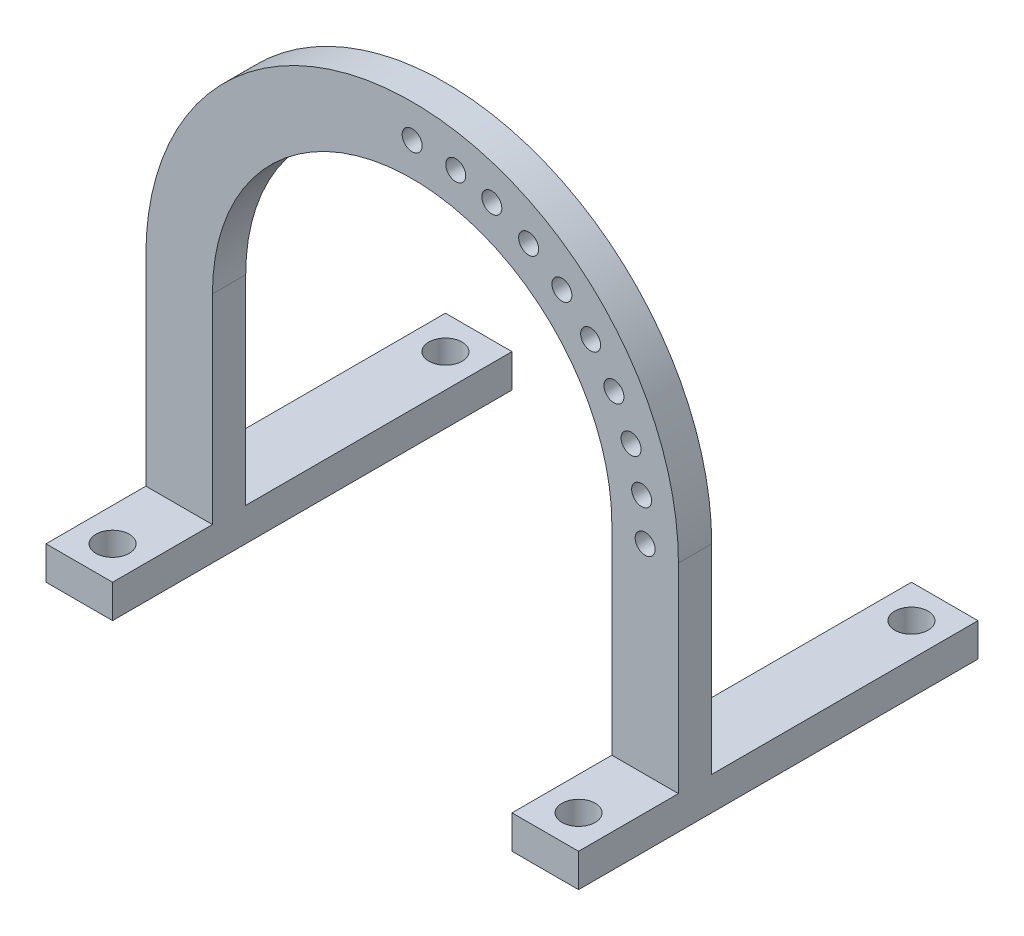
ISO-10303-21;
HEADER;
FILE_DESCRIPTION(('STEP AP214'),'2;1');
FILE_NAME('part.step','',(''),(''),'','','');
FILE_SCHEMA(('AUTOMOTIVE_DESIGN { 1 0 10303 214 1 1 1 1 }'));
ENDSEC;
DATA;
#1=APPLICATION_CONTEXT('core data for automotive mechanical design processes');
#2=APPLICATION_PROTOCOL_DEFINITION('international standard','automotive_design',2000,#1);
#3=PRODUCT_CONTEXT('',#1,'mechanical');
#4=PRODUCT('Part','Part','',(#3));
#5=PRODUCT_RELATED_PRODUCT_CATEGORY('part','',(#4));
#6=PRODUCT_DEFINITION_FORMATION('','',#4);
#7=PRODUCT_DEFINITION_CONTEXT('part definition',#1,'design');
#8=PRODUCT_DEFINITION('design','',#6,#7);
#9=PRODUCT_DEFINITION_SHAPE('','',#8);
#10=(LENGTH_UNIT() NAMED_UNIT(*) SI_UNIT(.MILLI.,.METRE.));
#11=(NAMED_UNIT(*) PLANE_ANGLE_UNIT() SI_UNIT($,.RADIAN.));
#12=(NAMED_UNIT(*) SI_UNIT($,.STERADIAN.) SOLID_ANGLE_UNIT());
#13=UNCERTAINTY_MEASURE_WITH_UNIT(LENGTH_MEASURE(1.E-05),#10,'distance_accuracy_value','');
#14=(GEOMETRIC_REPRESENTATION_CONTEXT(3) GLOBAL_UNCERTAINTY_ASSIGNED_CONTEXT((#13)) GLOBAL_UNIT_ASSIGNED_CONTEXT((#10,
#11,#12)) REPRESENTATION_CONTEXT('',''));
#15=CARTESIAN_POINT('',(0.,0.,0.));
#16=DIRECTION('',(0.,0.,1.));
#17=DIRECTION('',(1.,0.,0.));
#18=AXIS2_PLACEMENT_3D('',#15,#16,#17);
#19=CARTESIAN_POINT('',(-10.,35.,-0.104763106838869));
#20=DIRECTION('',(0.,0.,-1.));
#21=DIRECTION('',(-1.,0.,0.));
#22=AXIS2_PLACEMENT_3D('',#19,#20,#21);
#23=PLANE('',#22);
#24=CARTESIAN_POINT('',(65.,35.,-0.104763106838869));
#25=DIRECTION('',(0.,0.,1.));
#26=DIRECTION('',(1.,0.,0.));
#27=AXIS2_PLACEMENT_3D('',#24,#25,#26);
#28=CIRCLE('',#27,1.5);
#29=CARTESIAN_POINT('',(66.5,35.,-0.104763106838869));
#30=VERTEX_POINT('',#29);
#31=EDGE_CURVE('E229',#30,#30,#28,.T.);
#32=ORIENTED_EDGE('',*,*,#31,.F.);
#33=EDGE_LOOP('',(#32));
#34=FACE_BOUND('',#33,.T.);
#35=CARTESIAN_POINT('',(64.4682713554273,41.0776862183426,-0.104763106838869));
#36=DIRECTION('',(0.,0.,1.));
#37=DIRECTION('',(1.,0.,0.));
#38=AXIS2_PLACEMENT_3D('',#35,#36,#37);
#39=CIRCLE('',#38,1.5);
#40=CARTESIAN_POINT('',(65.9682713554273,41.0776862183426,-0.104763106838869));
#41=VERTEX_POINT('',#40);
#42=EDGE_CURVE('E233',#41,#41,#39,.T.);
#43=ORIENTED_EDGE('',*,*,#42,.F.);
#44=EDGE_LOOP('',(#43));
#45=FACE_BOUND('',#44,.T.);
#46=CARTESIAN_POINT('',(62.8892417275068,46.9707050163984,-0.104763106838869));
#47=DIRECTION('',(0.,0.,1.));
#48=DIRECTION('',(1.,0.,0.));
#49=AXIS2_PLACEMENT_3D('',#46,#47,#48);
#50=CIRCLE('',#49,1.5);
#51=CARTESIAN_POINT('',(64.3892417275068,46.9707050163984,-0.104763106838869));
#52=VERTEX_POINT('',#51);
#53=EDGE_CURVE('E237',#52,#52,#50,.T.);
#54=ORIENTED_EDGE('',*,*,#53,.F.);
#55=EDGE_LOOP('',(#54));
#56=FACE_BOUND('',#55,.T.);
#57=CARTESIAN_POINT('',(60.3108891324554,52.5,-0.104763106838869));
#58=DIRECTION('',(0.,0.,1.));
#59=DIRECTION('',(1.,0.,0.));
#60=AXIS2_PLACEMENT_3D('',#57,#58,#59);
#61=CIRCLE('',#60,1.5);
#62=CARTESIAN_POINT('',(61.8108891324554,52.5,-0.104763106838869));
#63=VERTEX_POINT('',#62);
#64=EDGE_CURVE('E241',#63,#63,#61,.T.);
#65=ORIENTED_EDGE('',*,*,#64,.F.);
#66=EDGE_LOOP('',(#65));
#67=FACE_BOUND('',#66,.T.);
#68=CARTESIAN_POINT('',(56.8115555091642,57.4975663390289,-0.104763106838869));
#69=DIRECTION('',(0.,0.,1.));
#70=DIRECTION('',(1.,0.,0.));
#71=AXIS2_PLACEMENT_3D('',#68,#69,#70);
#72=CIRCLE('',#71,1.5);
#73=CARTESIAN_POINT('',(58.3115555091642,57.4975663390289,-0.104763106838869));
#74=VERTEX_POINT('',#73);
#75=EDGE_CURVE('E245',#74,#74,#72,.T.);
#76=ORIENTED_EDGE('',*,*,#75,.F.);
#77=EDGE_LOOP('',(#76));
#78=FACE_BOUND('',#77,.T.);
#79=CARTESIAN_POINT('',(52.4975663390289,61.8115555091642,-0.104763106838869));
#80=DIRECTION('',(0.,0.,1.));
#81=DIRECTION('',(1.,0.,0.));
#82=AXIS2_PLACEMENT_3D('',#79,#80,#81);
#83=CIRCLE('',#82,1.5);
#84=CARTESIAN_POINT('',(53.9975663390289,61.8115555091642,-0.104763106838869));
#85=VERTEX_POINT('',#84);
#86=EDGE_CURVE('E249',#85,#85,#83,.T.);
#87=ORIENTED_EDGE('',*,*,#86,.F.);
#88=EDGE_LOOP('',(#87));
#89=FACE_BOUND('',#88,.T.);
#90=CARTESIAN_POINT('',(47.5,65.3108891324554,-0.104763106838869));
#91=DIRECTION('',(0.,0.,1.));
#92=DIRECTION('',(1.,0.,0.));
#93=AXIS2_PLACEMENT_3D('',#90,#91,#92);
#94=CIRCLE('',#93,1.5);
#95=CARTESIAN_POINT('',(49.,65.3108891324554,-0.104763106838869));
#96=VERTEX_POINT('',#95);
#97=EDGE_CURVE('E253',#96,#96,#94,.T.);
#98=ORIENTED_EDGE('',*,*,#97,.F.);
#99=EDGE_LOOP('',(#98));
#100=FACE_BOUND('',#99,.T.);
#101=CARTESIAN_POINT('',(41.9707050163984,67.8892417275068,-0.104763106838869));
#102=DIRECTION('',(0.,0.,1.));
#103=DIRECTION('',(1.,0.,0.));
#104=AXIS2_PLACEMENT_3D('',#101,#102,#103);
#105=CIRCLE('',#104,1.5);
#106=CARTESIAN_POINT('',(43.4707050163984,67.8892417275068,-0.104763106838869));
#107=VERTEX_POINT('',#106);
#108=EDGE_CURVE('E257',#107,#107,#105,.T.);
#109=ORIENTED_EDGE('',*,*,#108,.F.);
#110=EDGE_LOOP('',(#109));
#111=FACE_BOUND('',#110,.T.);
#112=CARTESIAN_POINT('',(36.5499113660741,69.3816616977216,-0.104763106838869));
#113=DIRECTION('',(0.,0.,1.));
#114=DIRECTION('',(1.,0.,0.));
#115=AXIS2_PLACEMENT_3D('',#112,#113,#114);
#116=CIRCLE('',#115,1.5);
#117=CARTESIAN_POINT('',(38.0499113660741,69.3816616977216,-0.104763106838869));
#118=VERTEX_POINT('',#117);
#119=EDGE_CURVE('E261',#118,#118,#116,.T.);
#120=ORIENTED_EDGE('',*,*,#119,.F.);
#121=EDGE_LOOP('',(#120));
#122=FACE_BOUND('',#121,.T.);
#123=CARTESIAN_POINT('',(30.,70.,-0.104763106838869));
#124=DIRECTION('',(0.,0.,1.));
#125=DIRECTION('',(1.,0.,0.));
#126=AXIS2_PLACEMENT_3D('',#123,#124,#125);
#127=CIRCLE('',#126,1.5);
#128=CARTESIAN_POINT('',(31.5,70.,-0.104763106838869));
#129=VERTEX_POINT('',#128);
#130=EDGE_CURVE('E265',#129,#129,#127,.T.);
#131=ORIENTED_EDGE('',*,*,#130,.F.);
#132=EDGE_LOOP('',(#131));
#133=FACE_BOUND('',#132,.T.);
#134=DIRECTION('',(-1.,0.,0.));
#135=VECTOR('',#134,1.);
#136=CARTESIAN_POINT('',(-10.,5.,-0.104763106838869));
#137=LINE('',#136,#135);
#138=CARTESIAN_POINT('',(70.,5.,-0.104763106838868));
#139=VERTEX_POINT('',#138);
#140=CARTESIAN_POINT('',(60.,5.,-0.104763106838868));
#141=VERTEX_POINT('',#140);
#142=EDGE_CURVE('E194',#139,#141,#137,.T.);
#143=ORIENTED_EDGE('',*,*,#142,.F.);
#144=DIRECTION('',(0.,-1.,0.));
#145=VECTOR('',#144,1.);
#146=CARTESIAN_POINT('',(70.,35.,-0.104763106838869));
#147=LINE('',#146,#145);
#148=CARTESIAN_POINT('',(70.,35.,-0.104763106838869));
#149=VERTEX_POINT('',#148);
#150=EDGE_CURVE('E45',#149,#139,#147,.T.);
#151=ORIENTED_EDGE('',*,*,#150,.F.);
#152=CARTESIAN_POINT('',(30.,35.,-0.104763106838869));
#153=DIRECTION('',(0.,0.,-1.));
#154=DIRECTION('',(-1.,0.,0.));
#155=AXIS2_PLACEMENT_3D('',#152,#153,#154);
#156=CIRCLE('',#155,40.);
#157=CARTESIAN_POINT('',(-10.,35.,-0.104763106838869));
#158=VERTEX_POINT('',#157);
#159=EDGE_CURVE('E303',#158,#149,#156,.T.);
#160=ORIENTED_EDGE('',*,*,#159,.F.);
#161=DIRECTION('',(0.,-1.,0.));
#162=VECTOR('',#161,1.);
#163=CARTESIAN_POINT('',(-10.,35.,-0.104763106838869));
#164=LINE('',#163,#162);
#165=CARTESIAN_POINT('',(-10.,5.,-0.104763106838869));
#166=VERTEX_POINT('',#165);
#167=EDGE_CURVE('E288',#158,#166,#164,.T.);
#168=ORIENTED_EDGE('',*,*,#167,.T.);
#169=DIRECTION('',(-1.,0.,0.));
#170=VECTOR('',#169,1.);
#171=CARTESIAN_POINT('',(-9.99999999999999,5.,-0.104763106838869));
#172=LINE('',#171,#170);
#173=CARTESIAN_POINT('',(0.,5.,-0.104763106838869));
#174=VERTEX_POINT('',#173);
#175=EDGE_CURVE('E226',#174,#166,#172,.T.);
#176=ORIENTED_EDGE('',*,*,#175,.F.);
#177=DIRECTION('',(0.,-1.,0.));
#178=VECTOR('',#177,1.);
#179=CARTESIAN_POINT('',(0.,35.,-0.104763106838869));
#180=LINE('',#179,#178);
#181=CARTESIAN_POINT('',(0.,35.,-0.104763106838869));
#182=VERTEX_POINT('',#181);
#183=EDGE_CURVE('E285',#182,#174,#180,.T.);
#184=ORIENTED_EDGE('',*,*,#183,.F.);
#185=CARTESIAN_POINT('',(30.,35.,-0.104763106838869));
#186=DIRECTION('',(0.,0.,-1.));
#187=DIRECTION('',(-1.,0.,0.));
#188=AXIS2_PLACEMENT_3D('',#185,#186,#187);
#189=CIRCLE('',#188,30.);
#190=CARTESIAN_POINT('',(60.,35.,-0.104763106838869));
#191=VERTEX_POINT('',#190);
#192=EDGE_CURVE('E300',#182,#191,#189,.T.);
#193=ORIENTED_EDGE('',*,*,#192,.T.);
#194=DIRECTION('',(0.,-1.,0.));
#195=VECTOR('',#194,1.);
#196=CARTESIAN_POINT('',(60.,35.,-0.104763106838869));
#197=LINE('',#196,#195);
#198=EDGE_CURVE('E312',#191,#141,#197,.T.);
#199=ORIENTED_EDGE('',*,*,#198,.T.);
#200=EDGE_LOOP('',(#143,#151,#160,#168,#176,#184,#193,#199));
#201=FACE_BOUND('',#200,.T.);
#202=ADVANCED_FACE('F37',(#34,#45,#56,#67,#78,#89,#100,#111,#122,#133,#201),#23,.F.);
#203=CARTESIAN_POINT('',(-10.,35.,-5.10476310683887));
#204=DIRECTION('',(0.,0.,1.));
#205=DIRECTION('',(1.,0.,0.));
#206=AXIS2_PLACEMENT_3D('',#203,#204,#205);
#207=PLANE('',#206);
#208=CARTESIAN_POINT('',(65.,35.,-5.10476310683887));
#209=DIRECTION('',(0.,0.,1.));
#210=DIRECTION('',(1.,0.,0.));
#211=AXIS2_PLACEMENT_3D('',#208,#209,#210);
#212=CIRCLE('',#211,1.5);
#213=CARTESIAN_POINT('',(66.5,35.,-5.10476310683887));
#214=VERTEX_POINT('',#213);
#215=EDGE_CURVE('E232',#214,#214,#212,.T.);
#216=ORIENTED_EDGE('',*,*,#215,.T.);
#217=EDGE_LOOP('',(#216));
#218=FACE_BOUND('',#217,.T.);
#219=CARTESIAN_POINT('',(64.4682713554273,41.0776862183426,-5.10476310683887));
#220=DIRECTION('',(0.,0.,1.));
#221=DIRECTION('',(1.,0.,0.));
#222=AXIS2_PLACEMENT_3D('',#219,#220,#221);
#223=CIRCLE('',#222,1.5);
#224=CARTESIAN_POINT('',(65.9682713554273,41.0776862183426,-5.10476310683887));
#225=VERTEX_POINT('',#224);
#226=EDGE_CURVE('E236',#225,#225,#223,.T.);
#227=ORIENTED_EDGE('',*,*,#226,.T.);
#228=EDGE_LOOP('',(#227));
#229=FACE_BOUND('',#228,.T.);
#230=CARTESIAN_POINT('',(62.8892417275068,46.9707050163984,-5.10476310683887));
#231=DIRECTION('',(0.,0.,1.));
#232=DIRECTION('',(1.,0.,0.));
#233=AXIS2_PLACEMENT_3D('',#230,#231,#232);
#234=CIRCLE('',#233,1.5);
#235=CARTESIAN_POINT('',(64.3892417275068,46.9707050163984,-5.10476310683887));
#236=VERTEX_POINT('',#235);
#237=EDGE_CURVE('E240',#236,#236,#234,.T.);
#238=ORIENTED_EDGE('',*,*,#237,.T.);
#239=EDGE_LOOP('',(#238));
#240=FACE_BOUND('',#239,.T.);
#241=CARTESIAN_POINT('',(60.3108891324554,52.5,-5.10476310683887));
#242=DIRECTION('',(0.,0.,1.));
#243=DIRECTION('',(1.,0.,0.));
#244=AXIS2_PLACEMENT_3D('',#241,#242,#243);
#245=CIRCLE('',#244,1.5);
#246=CARTESIAN_POINT('',(61.8108891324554,52.5,-5.10476310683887));
#247=VERTEX_POINT('',#246);
#248=EDGE_CURVE('E244',#247,#247,#245,.T.);
#249=ORIENTED_EDGE('',*,*,#248,.T.);
#250=EDGE_LOOP('',(#249));
#251=FACE_BOUND('',#250,.T.);
#252=CARTESIAN_POINT('',(56.8115555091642,57.4975663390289,-5.10476310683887));
#253=DIRECTION('',(0.,0.,1.));
#254=DIRECTION('',(1.,0.,0.));
#255=AXIS2_PLACEMENT_3D('',#252,#253,#254);
#256=CIRCLE('',#255,1.5);
#257=CARTESIAN_POINT('',(58.3115555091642,57.4975663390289,-5.10476310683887));
#258=VERTEX_POINT('',#257);
#259=EDGE_CURVE('E248',#258,#258,#256,.T.);
#260=ORIENTED_EDGE('',*,*,#259,.T.);
#261=EDGE_LOOP('',(#260));
#262=FACE_BOUND('',#261,.T.);
#263=CARTESIAN_POINT('',(52.4975663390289,61.8115555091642,-5.10476310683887));
#264=DIRECTION('',(0.,0.,1.));
#265=DIRECTION('',(1.,0.,0.));
#266=AXIS2_PLACEMENT_3D('',#263,#264,#265);
#267=CIRCLE('',#266,1.5);
#268=CARTESIAN_POINT('',(53.9975663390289,61.8115555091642,-5.10476310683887));
#269=VERTEX_POINT('',#268);
#270=EDGE_CURVE('E252',#269,#269,#267,.T.);
#271=ORIENTED_EDGE('',*,*,#270,.T.);
#272=EDGE_LOOP('',(#271));
#273=FACE_BOUND('',#272,.T.);
#274=CARTESIAN_POINT('',(47.5,65.3108891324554,-5.10476310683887));
#275=DIRECTION('',(0.,0.,1.));
#276=DIRECTION('',(1.,0.,0.));
#277=AXIS2_PLACEMENT_3D('',#274,#275,#276);
#278=CIRCLE('',#277,1.5);
#279=CARTESIAN_POINT('',(49.,65.3108891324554,-5.10476310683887));
#280=VERTEX_POINT('',#279);
#281=EDGE_CURVE('E256',#280,#280,#278,.T.);
#282=ORIENTED_EDGE('',*,*,#281,.T.);
#283=EDGE_LOOP('',(#282));
#284=FACE_BOUND('',#283,.T.);
#285=CARTESIAN_POINT('',(41.9707050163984,67.8892417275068,-5.10476310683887));
#286=DIRECTION('',(0.,0.,1.));
#287=DIRECTION('',(1.,0.,0.));
#288=AXIS2_PLACEMENT_3D('',#285,#286,#287);
#289=CIRCLE('',#288,1.5);
#290=CARTESIAN_POINT('',(43.4707050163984,67.8892417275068,-5.10476310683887));
#291=VERTEX_POINT('',#290);
#292=EDGE_CURVE('E260',#291,#291,#289,.T.);
#293=ORIENTED_EDGE('',*,*,#292,.T.);
#294=EDGE_LOOP('',(#293));
#295=FACE_BOUND('',#294,.T.);
#296=CARTESIAN_POINT('',(36.5499113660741,69.3816616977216,-5.10476310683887));
#297=DIRECTION('',(0.,0.,1.));
#298=DIRECTION('',(1.,0.,0.));
#299=AXIS2_PLACEMENT_3D('',#296,#297,#298);
#300=CIRCLE('',#299,1.5);
#301=CARTESIAN_POINT('',(38.0499113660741,69.3816616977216,-5.10476310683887));
#302=VERTEX_POINT('',#301);
#303=EDGE_CURVE('E264',#302,#302,#300,.T.);
#304=ORIENTED_EDGE('',*,*,#303,.T.);
#305=EDGE_LOOP('',(#304));
#306=FACE_BOUND('',#305,.T.);
#307=CARTESIAN_POINT('',(30.,70.,-5.10476310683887));
#308=DIRECTION('',(0.,0.,1.));
#309=DIRECTION('',(1.,0.,0.));
#310=AXIS2_PLACEMENT_3D('',#307,#308,#309);
#311=CIRCLE('',#310,1.5);
#312=CARTESIAN_POINT('',(31.5,70.,-5.10476310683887));
#313=VERTEX_POINT('',#312);
#314=EDGE_CURVE('E268',#313,#313,#311,.T.);
#315=ORIENTED_EDGE('',*,*,#314,.T.);
#316=EDGE_LOOP('',(#315));
#317=FACE_BOUND('',#316,.T.);
#318=DIRECTION('',(1.,0.,0.));
#319=VECTOR('',#318,1.);
#320=CARTESIAN_POINT('',(-10.,5.,-5.10476310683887));
#321=LINE('',#320,#319);
#322=CARTESIAN_POINT('',(60.,5.,-5.10476310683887));
#323=VERTEX_POINT('',#322);
#324=CARTESIAN_POINT('',(70.,5.,-5.10476310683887));
#325=VERTEX_POINT('',#324);
#326=EDGE_CURVE('E52',#323,#325,#321,.T.);
#327=ORIENTED_EDGE('',*,*,#326,.F.);
#328=DIRECTION('',(0.,-1.,0.));
#329=VECTOR('',#328,1.);
#330=CARTESIAN_POINT('',(60.,35.,-5.10476310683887));
#331=LINE('',#330,#329);
#332=CARTESIAN_POINT('',(60.,35.,-5.10476310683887));
#333=VERTEX_POINT('',#332);
#334=EDGE_CURVE('E151',#333,#323,#331,.T.);
#335=ORIENTED_EDGE('',*,*,#334,.F.);
#336=CARTESIAN_POINT('',(30.,35.,-5.10476310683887));
#337=DIRECTION('',(0.,0.,-1.));
#338=DIRECTION('',(-1.,0.,0.));
#339=AXIS2_PLACEMENT_3D('',#336,#337,#338);
#340=CIRCLE('',#339,30.);
#341=CARTESIAN_POINT('',(0.,35.,-5.10476310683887));
#342=VERTEX_POINT('',#341);
#343=EDGE_CURVE('E297',#342,#333,#340,.T.);
#344=ORIENTED_EDGE('',*,*,#343,.F.);
#345=DIRECTION('',(0.,-1.,0.));
#346=VECTOR('',#345,1.);
#347=CARTESIAN_POINT('',(0.,35.,-5.10476310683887));
#348=LINE('',#347,#346);
#349=CARTESIAN_POINT('',(0.,5.,-5.10476310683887));
#350=VERTEX_POINT('',#349);
#351=EDGE_CURVE('E282',#342,#350,#348,.T.);
#352=ORIENTED_EDGE('',*,*,#351,.T.);
#353=DIRECTION('',(1.,0.,0.));
#354=VECTOR('',#353,1.);
#355=CARTESIAN_POINT('',(-10.,5.,-5.10476310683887));
#356=LINE('',#355,#354);
#357=CARTESIAN_POINT('',(-10.,5.,-5.10476310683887));
#358=VERTEX_POINT('',#357);
#359=EDGE_CURVE('E11',#358,#350,#356,.T.);
#360=ORIENTED_EDGE('',*,*,#359,.F.);
#361=DIRECTION('',(0.,-1.,0.));
#362=VECTOR('',#361,1.);
#363=CARTESIAN_POINT('',(-10.,35.,-5.10476310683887));
#364=LINE('',#363,#362);
#365=CARTESIAN_POINT('',(-10.,35.,-5.10476310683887));
#366=VERTEX_POINT('',#365);
#367=EDGE_CURVE('E276',#366,#358,#364,.T.);
#368=ORIENTED_EDGE('',*,*,#367,.F.);
#369=CARTESIAN_POINT('',(30.,35.,-5.10476310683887));
#370=DIRECTION('',(0.,0.,-1.));
#371=DIRECTION('',(-1.,0.,0.));
#372=AXIS2_PLACEMENT_3D('',#369,#370,#371);
#373=CIRCLE('',#372,40.);
#374=CARTESIAN_POINT('',(70.,35.,-5.10476310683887));
#375=VERTEX_POINT('',#374);
#376=EDGE_CURVE('E295',#366,#375,#373,.T.);
#377=ORIENTED_EDGE('',*,*,#376,.T.);
#378=DIRECTION('',(0.,-1.,0.));
#379=VECTOR('',#378,1.);
#380=CARTESIAN_POINT('',(70.,35.,-5.10476310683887));
#381=LINE('',#380,#379);
#382=EDGE_CURVE('E57',#375,#325,#381,.T.);
#383=ORIENTED_EDGE('',*,*,#382,.T.);
#384=EDGE_LOOP('',(#327,#335,#344,#352,#360,#368,#377,#383));
#385=FACE_BOUND('',#384,.T.);
#386=ADVANCED_FACE('F337',(#218,#229,#240,#251,#262,#273,#284,#295,#306,#317,#385),#207,.F.);
#387=CARTESIAN_POINT('',(60.,35.,-5.10476310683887));
#388=DIRECTION('',(-1.,0.,0.));
#389=DIRECTION('',(0.,-1.,0.));
#390=AXIS2_PLACEMENT_3D('',#387,#388,#389);
#391=PLANE('',#390);
#392=DIRECTION('',(0.,0.,-1.));
#393=VECTOR('',#392,1.);
#394=CARTESIAN_POINT('',(60.,0.,-5.10476310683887));
#395=LINE('',#394,#393);
#396=CARTESIAN_POINT('',(60.,0.,14.8952368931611));
#397=VERTEX_POINT('',#396);
#398=CARTESIAN_POINT('',(60.,0.,-45.1047631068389));
#399=VERTEX_POINT('',#398);
#400=EDGE_CURVE('E308',#397,#399,#395,.T.);
#401=ORIENTED_EDGE('',*,*,#400,.F.);
#402=DIRECTION('',(0.,-1.,0.));
#403=VECTOR('',#402,1.);
#404=CARTESIAN_POINT('',(60.,35.,14.8952368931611));
#405=LINE('',#404,#403);
#406=CARTESIAN_POINT('',(60.,5.,14.8952368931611));
#407=VERTEX_POINT('',#406);
#408=EDGE_CURVE('E183',#407,#397,#405,.T.);
#409=ORIENTED_EDGE('',*,*,#408,.F.);
#410=DIRECTION('',(0.,0.,-1.));
#411=VECTOR('',#410,1.);
#412=CARTESIAN_POINT('',(60.,5.,14.8952368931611));
#413=LINE('',#412,#411);
#414=EDGE_CURVE('E154',#407,#141,#413,.T.);
#415=ORIENTED_EDGE('',*,*,#414,.T.);
#416=ORIENTED_EDGE('',*,*,#198,.F.);
#417=DIRECTION('',(0.,0.,-1.));
#418=VECTOR('',#417,1.);
#419=CARTESIAN_POINT('',(60.,35.,-5.10476310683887));
#420=LINE('',#419,#418);
#421=EDGE_CURVE('E293',#191,#333,#420,.T.);
#422=ORIENTED_EDGE('',*,*,#421,.T.);
#423=ORIENTED_EDGE('',*,*,#334,.T.);
#424=CARTESIAN_POINT('',(60.,5.,-45.1047631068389));
#425=VERTEX_POINT('',#424);
#426=EDGE_CURVE('E147',#323,#425,#413,.T.);
#427=ORIENTED_EDGE('',*,*,#426,.T.);
#428=DIRECTION('',(0.,-1.,0.));
#429=VECTOR('',#428,1.);
#430=CARTESIAN_POINT('',(60.,35.,-45.1047631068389));
#431=LINE('',#430,#429);
#432=EDGE_CURVE('E149',#425,#399,#431,.T.);
#433=ORIENTED_EDGE('',*,*,#432,.T.);
#434=EDGE_LOOP('',(#401,#409,#415,#416,#422,#423,#427,#433));
#435=FACE_BOUND('',#434,.T.);
#436=ADVANCED_FACE('F39',(#435),#391,.T.);
#437=CARTESIAN_POINT('',(70.,35.,-5.10476310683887));
#438=DIRECTION('',(1.,0.,0.));
#439=DIRECTION('',(0.,0.,-1.));
#440=AXIS2_PLACEMENT_3D('',#437,#438,#439);
#441=PLANE('',#440);
#442=DIRECTION('',(0.,0.,1.));
#443=VECTOR('',#442,1.);
#444=CARTESIAN_POINT('',(70.,0.,-5.10476310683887));
#445=LINE('',#444,#443);
#446=CARTESIAN_POINT('',(70.,0.,-45.1047631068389));
#447=VERTEX_POINT('',#446);
#448=CARTESIAN_POINT('',(70.,0.,14.8952368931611));
#449=VERTEX_POINT('',#448);
#450=EDGE_CURVE('E306',#447,#449,#445,.T.);
#451=ORIENTED_EDGE('',*,*,#450,.F.);
#452=DIRECTION('',(0.,1.,0.));
#453=VECTOR('',#452,1.);
#454=CARTESIAN_POINT('',(70.,35.,-45.1047631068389));
#455=LINE('',#454,#453);
#456=CARTESIAN_POINT('',(70.,5.,-45.1047631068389));
#457=VERTEX_POINT('',#456);
#458=EDGE_CURVE('E178',#447,#457,#455,.T.);
#459=ORIENTED_EDGE('',*,*,#458,.T.);
#460=DIRECTION('',(0.,0.,-1.));
#461=VECTOR('',#460,1.);
#462=CARTESIAN_POINT('',(70.,5.,14.8952368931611));
#463=LINE('',#462,#461);
#464=EDGE_CURVE('E169',#325,#457,#463,.T.);
#465=ORIENTED_EDGE('',*,*,#464,.F.);
#466=ORIENTED_EDGE('',*,*,#382,.F.);
#467=DIRECTION('',(0.,0.,1.));
#468=VECTOR('',#467,1.);
#469=CARTESIAN_POINT('',(70.,35.,-5.10476310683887));
#470=LINE('',#469,#468);
#471=EDGE_CURVE('E290',#375,#149,#470,.T.);
#472=ORIENTED_EDGE('',*,*,#471,.T.);
#473=ORIENTED_EDGE('',*,*,#150,.T.);
#474=CARTESIAN_POINT('',(70.,5.,14.8952368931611));
#475=VERTEX_POINT('',#474);
#476=EDGE_CURVE('E155',#475,#139,#463,.T.);
#477=ORIENTED_EDGE('',*,*,#476,.F.);
#478=DIRECTION('',(0.,1.,0.));
#479=VECTOR('',#478,1.);
#480=CARTESIAN_POINT('',(70.,35.,14.8952368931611));
#481=LINE('',#480,#479);
#482=EDGE_CURVE('E189',#449,#475,#481,.T.);
#483=ORIENTED_EDGE('',*,*,#482,.F.);
#484=EDGE_LOOP('',(#451,#459,#465,#466,#472,#473,#477,#483));
#485=FACE_BOUND('',#484,.T.);
#486=ADVANCED_FACE('F380',(#485),#441,.T.);
#487=CARTESIAN_POINT('',(30.,35.,0.));
#488=DIRECTION('',(0.,0.,-1.));
#489=DIRECTION('',(-1.,0.,0.));
#490=AXIS2_PLACEMENT_3D('',#487,#488,#489);
#491=CYLINDRICAL_SURFACE('',#490,30.);
#492=DIRECTION('',(0.,0.,-1.));
#493=VECTOR('',#492,1.);
#494=CARTESIAN_POINT('',(0.,35.,-5.10476310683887));
#495=LINE('',#494,#493);
#496=EDGE_CURVE('E272',#182,#342,#495,.T.);
#497=ORIENTED_EDGE('',*,*,#496,.T.);
#498=ORIENTED_EDGE('',*,*,#343,.T.);
#499=ORIENTED_EDGE('',*,*,#421,.F.);
#500=ORIENTED_EDGE('',*,*,#192,.F.);
#501=EDGE_LOOP('',(#497,#498,#499,#500));
#502=FACE_BOUND('',#501,.T.);
#503=ADVANCED_FACE('F377',(#502),#491,.F.);
#504=CARTESIAN_POINT('',(30.,35.,0.));
#505=DIRECTION('',(0.,0.,-1.));
#506=DIRECTION('',(-1.,0.,0.));
#507=AXIS2_PLACEMENT_3D('',#504,#505,#506);
#508=CYLINDRICAL_SURFACE('',#507,40.);
#509=DIRECTION('',(0.,0.,1.));
#510=VECTOR('',#509,1.);
#511=CARTESIAN_POINT('',(-10.,35.,-5.10476310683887));
#512=LINE('',#511,#510);
#513=EDGE_CURVE('E269',#366,#158,#512,.T.);
#514=ORIENTED_EDGE('',*,*,#513,.T.);
#515=ORIENTED_EDGE('',*,*,#159,.T.);
#516=ORIENTED_EDGE('',*,*,#471,.F.);
#517=ORIENTED_EDGE('',*,*,#376,.F.);
#518=EDGE_LOOP('',(#514,#515,#516,#517));
#519=FACE_BOUND('',#518,.T.);
#520=ADVANCED_FACE('F373',(#519),#508,.T.);
#521=CARTESIAN_POINT('',(-10.,35.,-5.10476310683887));
#522=DIRECTION('',(1.,0.,0.));
#523=DIRECTION('',(0.,0.,-1.));
#524=AXIS2_PLACEMENT_3D('',#521,#522,#523);
#525=PLANE('',#524);
#526=DIRECTION('',(0.,0.,1.));
#527=VECTOR('',#526,1.);
#528=CARTESIAN_POINT('',(-10.,0.,-5.10476310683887));
#529=LINE('',#528,#527);
#530=CARTESIAN_POINT('',(-10.,0.,-45.1047631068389));
#531=VERTEX_POINT('',#530);
#532=CARTESIAN_POINT('',(-10.,0.,14.8952368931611));
#533=VERTEX_POINT('',#532);
#534=EDGE_CURVE('E277',#531,#533,#529,.T.);
#535=ORIENTED_EDGE('',*,*,#534,.T.);
#536=DIRECTION('',(0.,-1.,0.));
#537=VECTOR('',#536,1.);
#538=CARTESIAN_POINT('',(-10.0000000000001,35.,14.8952368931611));
#539=LINE('',#538,#537);
#540=CARTESIAN_POINT('',(-10.,5.,14.8952368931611));
#541=VERTEX_POINT('',#540);
#542=EDGE_CURVE('E215',#541,#533,#539,.T.);
#543=ORIENTED_EDGE('',*,*,#542,.F.);
#544=DIRECTION('',(0.,0.,-1.));
#545=VECTOR('',#544,1.);
#546=CARTESIAN_POINT('',(-10.,5.,14.8952368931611));
#547=LINE('',#546,#545);
#548=EDGE_CURVE('E219',#541,#166,#547,.T.);
#549=ORIENTED_EDGE('',*,*,#548,.T.);
#550=ORIENTED_EDGE('',*,*,#167,.F.);
#551=ORIENTED_EDGE('',*,*,#513,.F.);
#552=ORIENTED_EDGE('',*,*,#367,.T.);
#553=CARTESIAN_POINT('',(-10.,5.,-45.1047631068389));
#554=VERTEX_POINT('',#553);
#555=EDGE_CURVE('E218',#358,#554,#547,.T.);
#556=ORIENTED_EDGE('',*,*,#555,.T.);
#557=DIRECTION('',(0.,-1.,0.));
#558=VECTOR('',#557,1.);
#559=CARTESIAN_POINT('',(-10.0000000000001,35.,-45.1047631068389));
#560=LINE('',#559,#558);
#561=EDGE_CURVE('E205',#554,#531,#560,.T.);
#562=ORIENTED_EDGE('',*,*,#561,.T.);
#563=EDGE_LOOP('',(#535,#543,#549,#550,#551,#552,#556,#562));
#564=FACE_BOUND('',#563,.T.);
#565=ADVANCED_FACE('F370',(#564),#525,.F.);
#566=CARTESIAN_POINT('',(0.,35.,-5.10476310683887));
#567=DIRECTION('',(-1.,0.,0.));
#568=DIRECTION('',(0.,0.,1.));
#569=AXIS2_PLACEMENT_3D('',#566,#567,#568);
#570=PLANE('',#569);
#571=DIRECTION('',(0.,0.,-1.));
#572=VECTOR('',#571,1.);
#573=CARTESIAN_POINT('',(0.,0.,-5.10476310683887));
#574=LINE('',#573,#572);
#575=CARTESIAN_POINT('',(0.,0.,14.8952368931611));
#576=VERTEX_POINT('',#575);
#577=CARTESIAN_POINT('',(0.,0.,-45.1047631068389));
#578=VERTEX_POINT('',#577);
#579=EDGE_CURVE('E273',#576,#578,#574,.T.);
#580=ORIENTED_EDGE('',*,*,#579,.T.);
#581=DIRECTION('',(0.,1.,0.));
#582=VECTOR('',#581,1.);
#583=CARTESIAN_POINT('',(0.,35.,-45.1047631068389));
#584=LINE('',#583,#582);
#585=CARTESIAN_POINT('',(0.,5.,-45.1047631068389));
#586=VERTEX_POINT('',#585);
#587=EDGE_CURVE('E199',#578,#586,#584,.T.);
#588=ORIENTED_EDGE('',*,*,#587,.T.);
#589=DIRECTION('',(0.,0.,-1.));
#590=VECTOR('',#589,1.);
#591=CARTESIAN_POINT('',(0.,5.,14.8952368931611));
#592=LINE('',#591,#590);
#593=EDGE_CURVE('E222',#350,#586,#592,.T.);
#594=ORIENTED_EDGE('',*,*,#593,.F.);
#595=ORIENTED_EDGE('',*,*,#351,.F.);
#596=ORIENTED_EDGE('',*,*,#496,.F.);
#597=ORIENTED_EDGE('',*,*,#183,.T.);
#598=CARTESIAN_POINT('',(0.,5.,14.8952368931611));
#599=VERTEX_POINT('',#598);
#600=EDGE_CURVE('E223',#599,#174,#592,.T.);
#601=ORIENTED_EDGE('',*,*,#600,.F.);
#602=DIRECTION('',(0.,1.,0.));
#603=VECTOR('',#602,1.);
#604=CARTESIAN_POINT('',(0.,35.,14.8952368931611));
#605=LINE('',#604,#603);
#606=EDGE_CURVE('E211',#576,#599,#605,.T.);
#607=ORIENTED_EDGE('',*,*,#606,.F.);
#608=EDGE_LOOP('',(#580,#588,#594,#595,#596,#597,#601,#607));
#609=FACE_BOUND('',#608,.T.);
#610=ADVANCED_FACE('F369',(#609),#570,.F.);
#611=CARTESIAN_POINT('',(60.,0.,0.));
#612=DIRECTION('',(0.,-1.,0.));
#613=DIRECTION('',(0.,0.,1.));
#614=AXIS2_PLACEMENT_3D('',#611,#612,#613);
#615=PLANE('',#614);
#616=CARTESIAN_POINT('',(65.,0.,-40.1047631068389));
#617=DIRECTION('',(0.,1.,0.));
#618=DIRECTION('',(0.,0.,1.));
#619=AXIS2_PLACEMENT_3D('',#616,#617,#618);
#620=CIRCLE('',#619,2.50000000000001);
#621=CARTESIAN_POINT('',(65.,0.,-37.6047631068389));
#622=VERTEX_POINT('',#621);
#623=EDGE_CURVE('E707',#622,#622,#620,.T.);
#624=ORIENTED_EDGE('',*,*,#623,.T.);
#625=EDGE_LOOP('',(#624));
#626=FACE_BOUND('',#625,.T.);
#627=CARTESIAN_POINT('',(65.,0.,9.89523689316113));
#628=DIRECTION('',(0.,1.,0.));
#629=DIRECTION('',(0.,0.,1.));
#630=AXIS2_PLACEMENT_3D('',#627,#628,#629);
#631=CIRCLE('',#630,2.5);
#632=CARTESIAN_POINT('',(65.,0.,12.3952368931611));
#633=VERTEX_POINT('',#632);
#634=EDGE_CURVE('E170',#633,#633,#631,.T.);
#635=ORIENTED_EDGE('',*,*,#634,.T.);
#636=EDGE_LOOP('',(#635));
#637=FACE_BOUND('',#636,.T.);
#638=ORIENTED_EDGE('',*,*,#450,.T.);
#639=DIRECTION('',(1.,0.,0.));
#640=VECTOR('',#639,1.);
#641=CARTESIAN_POINT('',(-10.,0.,14.8952368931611));
#642=LINE('',#641,#640);
#643=EDGE_CURVE('E186',#397,#449,#642,.T.);
#644=ORIENTED_EDGE('',*,*,#643,.F.);
#645=ORIENTED_EDGE('',*,*,#400,.T.);
#646=DIRECTION('',(1.,0.,0.));
#647=VECTOR('',#646,1.);
#648=CARTESIAN_POINT('',(-10.,0.,-45.1047631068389));
#649=LINE('',#648,#647);
#650=EDGE_CURVE('E165',#399,#447,#649,.T.);
#651=ORIENTED_EDGE('',*,*,#650,.T.);
#652=EDGE_LOOP('',(#638,#644,#645,#651));
#653=FACE_BOUND('',#652,.T.);
#654=ADVANCED_FACE('F391',(#626,#637,#653),#615,.T.);
#655=CARTESIAN_POINT('',(0.,0.,0.));
#656=DIRECTION('',(0.,1.,0.));
#657=DIRECTION('',(0.,0.,1.));
#658=AXIS2_PLACEMENT_3D('',#655,#656,#657);
#659=PLANE('',#658);
#660=CARTESIAN_POINT('',(-5.00000000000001,0.,9.89523689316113));
#661=DIRECTION('',(0.,1.,0.));
#662=DIRECTION('',(0.,0.,1.));
#663=AXIS2_PLACEMENT_3D('',#660,#661,#662);
#664=CIRCLE('',#663,2.5);
#665=CARTESIAN_POINT('',(-5.00000000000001,0.,12.3952368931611));
#666=VERTEX_POINT('',#665);
#667=EDGE_CURVE('E693',#666,#666,#664,.T.);
#668=ORIENTED_EDGE('',*,*,#667,.T.);
#669=EDGE_LOOP('',(#668));
#670=FACE_BOUND('',#669,.T.);
#671=CARTESIAN_POINT('',(-5.00000000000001,0.,-40.1047631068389));
#672=DIRECTION('',(0.,1.,0.));
#673=DIRECTION('',(0.,0.,1.));
#674=AXIS2_PLACEMENT_3D('',#671,#672,#673);
#675=CIRCLE('',#674,2.5);
#676=CARTESIAN_POINT('',(-5.00000000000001,0.,-37.6047631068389));
#677=VERTEX_POINT('',#676);
#678=EDGE_CURVE('E701',#677,#677,#675,.T.);
#679=ORIENTED_EDGE('',*,*,#678,.T.);
#680=EDGE_LOOP('',(#679));
#681=FACE_BOUND('',#680,.T.);
#682=ORIENTED_EDGE('',*,*,#534,.F.);
#683=DIRECTION('',(1.,0.,0.));
#684=VECTOR('',#683,1.);
#685=CARTESIAN_POINT('',(-10.,0.,-45.1047631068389));
#686=LINE('',#685,#684);
#687=EDGE_CURVE('E196',#531,#578,#686,.T.);
#688=ORIENTED_EDGE('',*,*,#687,.T.);
#689=ORIENTED_EDGE('',*,*,#579,.F.);
#690=DIRECTION('',(1.,0.,0.));
#691=VECTOR('',#690,1.);
#692=CARTESIAN_POINT('',(-10.,0.,14.8952368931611));
#693=LINE('',#692,#691);
#694=EDGE_CURVE('E208',#533,#576,#693,.T.);
#695=ORIENTED_EDGE('',*,*,#694,.F.);
#696=EDGE_LOOP('',(#682,#688,#689,#695));
#697=FACE_BOUND('',#696,.T.);
#698=ADVANCED_FACE('F426',(#670,#681,#697),#659,.F.);
#699=CARTESIAN_POINT('',(30.,70.,-10.1047631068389));
#700=DIRECTION('',(0.,0.,1.));
#701=DIRECTION('',(1.,0.,0.));
#702=AXIS2_PLACEMENT_3D('',#699,#700,#701);
#703=CYLINDRICAL_SURFACE('',#702,1.5);
#704=ORIENTED_EDGE('',*,*,#130,.T.);
#705=EDGE_LOOP('',(#704));
#706=FACE_BOUND('',#705,.T.);
#707=ORIENTED_EDGE('',*,*,#314,.F.);
#708=EDGE_LOOP('',(#707));
#709=FACE_BOUND('',#708,.T.);
#710=ADVANCED_FACE('F429',(#706,#709),#703,.F.);
#711=CARTESIAN_POINT('',(36.5499113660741,69.3816616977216,-10.1047631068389));
#712=DIRECTION('',(0.,0.,1.));
#713=DIRECTION('',(1.,0.,0.));
#714=AXIS2_PLACEMENT_3D('',#711,#712,#713);
#715=CYLINDRICAL_SURFACE('',#714,1.5);
#716=ORIENTED_EDGE('',*,*,#119,.T.);
#717=EDGE_LOOP('',(#716));
#718=FACE_BOUND('',#717,.T.);
#719=ORIENTED_EDGE('',*,*,#303,.F.);
#720=EDGE_LOOP('',(#719));
#721=FACE_BOUND('',#720,.T.);
#722=ADVANCED_FACE('F437',(#718,#721),#715,.F.);
#723=CARTESIAN_POINT('',(41.9707050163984,67.8892417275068,-10.1047631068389));
#724=DIRECTION('',(0.,0.,1.));
#725=DIRECTION('',(1.,0.,0.));
#726=AXIS2_PLACEMENT_3D('',#723,#724,#725);
#727=CYLINDRICAL_SURFACE('',#726,1.5);
#728=ORIENTED_EDGE('',*,*,#108,.T.);
#729=EDGE_LOOP('',(#728));
#730=FACE_BOUND('',#729,.T.);
#731=ORIENTED_EDGE('',*,*,#292,.F.);
#732=EDGE_LOOP('',(#731));
#733=FACE_BOUND('',#732,.T.);
#734=ADVANCED_FACE('F447',(#730,#733),#727,.F.);
#735=CARTESIAN_POINT('',(47.5,65.3108891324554,-10.1047631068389));
#736=DIRECTION('',(0.,0.,1.));
#737=DIRECTION('',(1.,0.,0.));
#738=AXIS2_PLACEMENT_3D('',#735,#736,#737);
#739=CYLINDRICAL_SURFACE('',#738,1.5);
#740=ORIENTED_EDGE('',*,*,#97,.T.);
#741=EDGE_LOOP('',(#740));
#742=FACE_BOUND('',#741,.T.);
#743=ORIENTED_EDGE('',*,*,#281,.F.);
#744=EDGE_LOOP('',(#743));
#745=FACE_BOUND('',#744,.T.);
#746=ADVANCED_FACE('F451',(#742,#745),#739,.F.);
#747=CARTESIAN_POINT('',(52.4975663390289,61.8115555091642,-10.1047631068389));
#748=DIRECTION('',(0.,0.,1.));
#749=DIRECTION('',(1.,0.,0.));
#750=AXIS2_PLACEMENT_3D('',#747,#748,#749);
#751=CYLINDRICAL_SURFACE('',#750,1.5);
#752=ORIENTED_EDGE('',*,*,#86,.T.);
#753=EDGE_LOOP('',(#752));
#754=FACE_BOUND('',#753,.T.);
#755=ORIENTED_EDGE('',*,*,#270,.F.);
#756=EDGE_LOOP('',(#755));
#757=FACE_BOUND('',#756,.T.);
#758=ADVANCED_FACE('F455',(#754,#757),#751,.F.);
#759=CARTESIAN_POINT('',(56.8115555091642,57.4975663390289,-10.1047631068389));
#760=DIRECTION('',(0.,0.,1.));
#761=DIRECTION('',(1.,0.,0.));
#762=AXIS2_PLACEMENT_3D('',#759,#760,#761);
#763=CYLINDRICAL_SURFACE('',#762,1.5);
#764=ORIENTED_EDGE('',*,*,#75,.T.);
#765=EDGE_LOOP('',(#764));
#766=FACE_BOUND('',#765,.T.);
#767=ORIENTED_EDGE('',*,*,#259,.F.);
#768=EDGE_LOOP('',(#767));
#769=FACE_BOUND('',#768,.T.);
#770=ADVANCED_FACE('F459',(#766,#769),#763,.F.);
#771=CARTESIAN_POINT('',(60.3108891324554,52.5,-10.1047631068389));
#772=DIRECTION('',(0.,0.,1.));
#773=DIRECTION('',(1.,0.,0.));
#774=AXIS2_PLACEMENT_3D('',#771,#772,#773);
#775=CYLINDRICAL_SURFACE('',#774,1.5);
#776=ORIENTED_EDGE('',*,*,#64,.T.);
#777=EDGE_LOOP('',(#776));
#778=FACE_BOUND('',#777,.T.);
#779=ORIENTED_EDGE('',*,*,#248,.F.);
#780=EDGE_LOOP('',(#779));
#781=FACE_BOUND('',#780,.T.);
#782=ADVANCED_FACE('F463',(#778,#781),#775,.F.);
#783=CARTESIAN_POINT('',(62.8892417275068,46.9707050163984,-10.1047631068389));
#784=DIRECTION('',(0.,0.,1.));
#785=DIRECTION('',(1.,0.,0.));
#786=AXIS2_PLACEMENT_3D('',#783,#784,#785);
#787=CYLINDRICAL_SURFACE('',#786,1.5);
#788=ORIENTED_EDGE('',*,*,#53,.T.);
#789=EDGE_LOOP('',(#788));
#790=FACE_BOUND('',#789,.T.);
#791=ORIENTED_EDGE('',*,*,#237,.F.);
#792=EDGE_LOOP('',(#791));
#793=FACE_BOUND('',#792,.T.);
#794=ADVANCED_FACE('F354',(#790,#793),#787,.F.);
#795=CARTESIAN_POINT('',(64.4682713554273,41.0776862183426,-10.1047631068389));
#796=DIRECTION('',(0.,0.,1.));
#797=DIRECTION('',(1.,0.,0.));
#798=AXIS2_PLACEMENT_3D('',#795,#796,#797);
#799=CYLINDRICAL_SURFACE('',#798,1.5);
#800=ORIENTED_EDGE('',*,*,#42,.T.);
#801=EDGE_LOOP('',(#800));
#802=FACE_BOUND('',#801,.T.);
#803=ORIENTED_EDGE('',*,*,#226,.F.);
#804=EDGE_LOOP('',(#803));
#805=FACE_BOUND('',#804,.T.);
#806=ADVANCED_FACE('F343',(#802,#805),#799,.F.);
#807=CARTESIAN_POINT('',(65.,35.,-10.1047631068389));
#808=DIRECTION('',(0.,0.,1.));
#809=DIRECTION('',(1.,0.,0.));
#810=AXIS2_PLACEMENT_3D('',#807,#808,#809);
#811=CYLINDRICAL_SURFACE('',#810,1.5);
#812=ORIENTED_EDGE('',*,*,#31,.T.);
#813=EDGE_LOOP('',(#812));
#814=FACE_BOUND('',#813,.T.);
#815=ORIENTED_EDGE('',*,*,#215,.F.);
#816=EDGE_LOOP('',(#815));
#817=FACE_BOUND('',#816,.T.);
#818=ADVANCED_FACE('F340',(#814,#817),#811,.F.);
#819=CARTESIAN_POINT('',(0.,0.,-45.1047631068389));
#820=DIRECTION('',(0.,0.,1.));
#821=DIRECTION('',(1.,0.,0.));
#822=AXIS2_PLACEMENT_3D('',#819,#820,#821);
#823=PLANE('',#822);
#824=ORIENTED_EDGE('',*,*,#687,.F.);
#825=ORIENTED_EDGE('',*,*,#561,.F.);
#826=DIRECTION('',(-1.,0.,0.));
#827=VECTOR('',#826,1.);
#828=CARTESIAN_POINT('',(-10.,5.,-45.1047631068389));
#829=LINE('',#828,#827);
#830=EDGE_CURVE('E202',#586,#554,#829,.T.);
#831=ORIENTED_EDGE('',*,*,#830,.F.);
#832=ORIENTED_EDGE('',*,*,#587,.F.);
#833=EDGE_LOOP('',(#824,#825,#831,#832));
#834=FACE_BOUND('',#833,.T.);
#835=ADVANCED_FACE('F342',(#834),#823,.F.);
#836=CARTESIAN_POINT('',(-10.,5.,14.8952368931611));
#837=DIRECTION('',(0.,-1.,0.));
#838=DIRECTION('',(1.,0.,0.));
#839=AXIS2_PLACEMENT_3D('',#836,#837,#838);
#840=PLANE('',#839);
#841=CARTESIAN_POINT('',(-5.00000000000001,5.,-40.1047631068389));
#842=DIRECTION('',(0.,1.,0.));
#843=DIRECTION('',(0.,0.,1.));
#844=AXIS2_PLACEMENT_3D('',#841,#842,#843);
#845=CIRCLE('',#844,2.5);
#846=CARTESIAN_POINT('',(-5.00000000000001,5.,-37.6047631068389));
#847=VERTEX_POINT('',#846);
#848=EDGE_CURVE('E698',#847,#847,#845,.T.);
#849=ORIENTED_EDGE('',*,*,#848,.F.);
#850=EDGE_LOOP('',(#849));
#851=FACE_BOUND('',#850,.T.);
#852=ORIENTED_EDGE('',*,*,#555,.F.);
#853=ORIENTED_EDGE('',*,*,#359,.T.);
#854=ORIENTED_EDGE('',*,*,#593,.T.);
#855=ORIENTED_EDGE('',*,*,#830,.T.);
#856=EDGE_LOOP('',(#852,#853,#854,#855));
#857=FACE_BOUND('',#856,.T.);
#858=ADVANCED_FACE('F351',(#851,#857),#840,.F.);
#859=CARTESIAN_POINT('',(-5.00000000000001,5.,9.89523689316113));
#860=DIRECTION('',(0.,1.,0.));
#861=DIRECTION('',(0.,0.,1.));
#862=AXIS2_PLACEMENT_3D('',#859,#860,#861);
#863=CIRCLE('',#862,2.5);
#864=CARTESIAN_POINT('',(-5.00000000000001,5.,12.3952368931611));
#865=VERTEX_POINT('',#864);
#866=EDGE_CURVE('E696',#865,#865,#863,.T.);
#867=ORIENTED_EDGE('',*,*,#866,.F.);
#868=EDGE_LOOP('',(#867));
#869=FACE_BOUND('',#868,.T.);
#870=ORIENTED_EDGE('',*,*,#600,.T.);
#871=ORIENTED_EDGE('',*,*,#175,.T.);
#872=ORIENTED_EDGE('',*,*,#548,.F.);
#873=DIRECTION('',(-1.,0.,0.));
#874=VECTOR('',#873,1.);
#875=CARTESIAN_POINT('',(-10.,5.,14.8952368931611));
#876=LINE('',#875,#874);
#877=EDGE_CURVE('E213',#599,#541,#876,.T.);
#878=ORIENTED_EDGE('',*,*,#877,.F.);
#879=EDGE_LOOP('',(#870,#871,#872,#878));
#880=FACE_BOUND('',#879,.T.);
#881=ADVANCED_FACE('F419',(#869,#880),#840,.F.);
#882=CARTESIAN_POINT('',(0.,0.,14.8952368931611));
#883=DIRECTION('',(0.,0.,1.));
#884=DIRECTION('',(1.,0.,0.));
#885=AXIS2_PLACEMENT_3D('',#882,#883,#884);
#886=PLANE('',#885);
#887=ORIENTED_EDGE('',*,*,#694,.T.);
#888=ORIENTED_EDGE('',*,*,#606,.T.);
#889=ORIENTED_EDGE('',*,*,#877,.T.);
#890=ORIENTED_EDGE('',*,*,#542,.T.);
#891=EDGE_LOOP('',(#887,#888,#889,#890));
#892=FACE_BOUND('',#891,.T.);
#893=ADVANCED_FACE('F424',(#892),#886,.T.);
#894=CARTESIAN_POINT('',(0.,0.,-45.1047631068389));
#895=DIRECTION('',(0.,0.,1.));
#896=DIRECTION('',(1.,0.,0.));
#897=AXIS2_PLACEMENT_3D('',#894,#895,#896);
#898=PLANE('',#897);
#899=DIRECTION('',(-1.,0.,0.));
#900=VECTOR('',#899,1.);
#901=CARTESIAN_POINT('',(-10.,5.,-45.1047631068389));
#902=LINE('',#901,#900);
#903=EDGE_CURVE('E162',#457,#425,#902,.T.);
#904=ORIENTED_EDGE('',*,*,#903,.F.);
#905=ORIENTED_EDGE('',*,*,#458,.F.);
#906=ORIENTED_EDGE('',*,*,#650,.F.);
#907=ORIENTED_EDGE('',*,*,#432,.F.);
#908=EDGE_LOOP('',(#904,#905,#906,#907));
#909=FACE_BOUND('',#908,.T.);
#910=ADVANCED_FACE('F160',(#909),#898,.F.);
#911=CARTESIAN_POINT('',(-10.,5.,14.8952368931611));
#912=DIRECTION('',(0.,-1.,0.));
#913=DIRECTION('',(0.,0.,-1.));
#914=AXIS2_PLACEMENT_3D('',#911,#912,#913);
#915=PLANE('',#914);
#916=CARTESIAN_POINT('',(65.,5.,-40.1047631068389));
#917=DIRECTION('',(0.,1.,0.));
#918=DIRECTION('',(0.,0.,1.));
#919=AXIS2_PLACEMENT_3D('',#916,#917,#918);
#920=CIRCLE('',#919,2.50000000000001);
#921=CARTESIAN_POINT('',(65.,5.,-37.6047631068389));
#922=VERTEX_POINT('',#921);
#923=EDGE_CURVE('E704',#922,#922,#920,.T.);
#924=ORIENTED_EDGE('',*,*,#923,.F.);
#925=EDGE_LOOP('',(#924));
#926=FACE_BOUND('',#925,.T.);
#927=ORIENTED_EDGE('',*,*,#426,.F.);
#928=ORIENTED_EDGE('',*,*,#326,.T.);
#929=ORIENTED_EDGE('',*,*,#464,.T.);
#930=ORIENTED_EDGE('',*,*,#903,.T.);
#931=EDGE_LOOP('',(#927,#928,#929,#930));
#932=FACE_BOUND('',#931,.T.);
#933=ADVANCED_FACE('F167',(#926,#932),#915,.F.);
#934=CARTESIAN_POINT('',(65.,5.,9.89523689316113));
#935=DIRECTION('',(0.,1.,0.));
#936=DIRECTION('',(0.,0.,1.));
#937=AXIS2_PLACEMENT_3D('',#934,#935,#936);
#938=CIRCLE('',#937,2.5);
#939=CARTESIAN_POINT('',(65.,5.,12.3952368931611));
#940=VERTEX_POINT('',#939);
#941=EDGE_CURVE('E173',#940,#940,#938,.T.);
#942=ORIENTED_EDGE('',*,*,#941,.F.);
#943=EDGE_LOOP('',(#942));
#944=FACE_BOUND('',#943,.T.);
#945=ORIENTED_EDGE('',*,*,#476,.T.);
#946=ORIENTED_EDGE('',*,*,#142,.T.);
#947=ORIENTED_EDGE('',*,*,#414,.F.);
#948=DIRECTION('',(-1.,0.,0.));
#949=VECTOR('',#948,1.);
#950=CARTESIAN_POINT('',(-10.,5.,14.8952368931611));
#951=LINE('',#950,#949);
#952=EDGE_CURVE('E180',#475,#407,#951,.T.);
#953=ORIENTED_EDGE('',*,*,#952,.F.);
#954=EDGE_LOOP('',(#945,#946,#947,#953));
#955=FACE_BOUND('',#954,.T.);
#956=ADVANCED_FACE('F397',(#944,#955),#915,.F.);
#957=CARTESIAN_POINT('',(0.,0.,14.8952368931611));
#958=DIRECTION('',(0.,0.,1.));
#959=DIRECTION('',(1.,0.,0.));
#960=AXIS2_PLACEMENT_3D('',#957,#958,#959);
#961=PLANE('',#960);
#962=ORIENTED_EDGE('',*,*,#952,.T.);
#963=ORIENTED_EDGE('',*,*,#408,.T.);
#964=ORIENTED_EDGE('',*,*,#643,.T.);
#965=ORIENTED_EDGE('',*,*,#482,.T.);
#966=EDGE_LOOP('',(#962,#963,#964,#965));
#967=FACE_BOUND('',#966,.T.);
#968=ADVANCED_FACE('F393',(#967),#961,.T.);
#969=CARTESIAN_POINT('',(65.,0.,9.89523689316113));
#970=DIRECTION('',(0.,1.,0.));
#971=DIRECTION('',(0.,0.,1.));
#972=AXIS2_PLACEMENT_3D('',#969,#970,#971);
#973=CYLINDRICAL_SURFACE('',#972,2.5);
#974=ORIENTED_EDGE('',*,*,#634,.F.);
#975=EDGE_LOOP('',(#974));
#976=FACE_BOUND('',#975,.T.);
#977=ORIENTED_EDGE('',*,*,#941,.T.);
#978=EDGE_LOOP('',(#977));
#979=FACE_BOUND('',#978,.T.);
#980=ADVANCED_FACE('F649',(#976,#979),#973,.F.);
#981=CARTESIAN_POINT('',(65.,0.,-40.1047631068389));
#982=DIRECTION('',(0.,1.,0.));
#983=DIRECTION('',(0.,0.,1.));
#984=AXIS2_PLACEMENT_3D('',#981,#982,#983);
#985=CYLINDRICAL_SURFACE('',#984,2.50000000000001);
#986=ORIENTED_EDGE('',*,*,#623,.F.);
#987=EDGE_LOOP('',(#986));
#988=FACE_BOUND('',#987,.T.);
#989=ORIENTED_EDGE('',*,*,#923,.T.);
#990=EDGE_LOOP('',(#989));
#991=FACE_BOUND('',#990,.T.);
#992=ADVANCED_FACE('F657',(#988,#991),#985,.F.);
#993=CARTESIAN_POINT('',(-5.00000000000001,0.,-40.1047631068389));
#994=DIRECTION('',(0.,1.,0.));
#995=DIRECTION('',(0.,0.,1.));
#996=AXIS2_PLACEMENT_3D('',#993,#994,#995);
#997=CYLINDRICAL_SURFACE('',#996,2.5);
#998=ORIENTED_EDGE('',*,*,#678,.F.);
#999=EDGE_LOOP('',(#998));
#1000=FACE_BOUND('',#999,.T.);
#1001=ORIENTED_EDGE('',*,*,#848,.T.);
#1002=EDGE_LOOP('',(#1001));
#1003=FACE_BOUND('',#1002,.T.);
#1004=ADVANCED_FACE('F666',(#1000,#1003),#997,.F.);
#1005=CARTESIAN_POINT('',(-5.00000000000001,0.,9.89523689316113));
#1006=DIRECTION('',(0.,1.,0.));
#1007=DIRECTION('',(0.,0.,1.));
#1008=AXIS2_PLACEMENT_3D('',#1005,#1006,#1007);
#1009=CYLINDRICAL_SURFACE('',#1008,2.5);
#1010=ORIENTED_EDGE('',*,*,#667,.F.);
#1011=EDGE_LOOP('',(#1010));
#1012=FACE_BOUND('',#1011,.T.);
#1013=ORIENTED_EDGE('',*,*,#866,.T.);
#1014=EDGE_LOOP('',(#1013));
#1015=FACE_BOUND('',#1014,.T.);
#1016=ADVANCED_FACE('F675',(#1012,#1015),#1009,.F.);
#1017=CLOSED_SHELL('',(#202,#386,#436,#486,#503,#520,#565,#610,#654,#698,#710,#722,#734,#746,
#758,#770,#782,#794,#806,#818,#835,#858,#881,#893,#910,#933,#956,#968,#980,#992,#1004,#1016));
#1018=MANIFOLD_SOLID_BREP('B2',#1017);
#1019=ADVANCED_BREP_SHAPE_REPRESENTATION('',(#18,#1018),#14);
#1020=SHAPE_DEFINITION_REPRESENTATION(#9,#1019);
ENDSEC;
END-ISO-10303-21;
